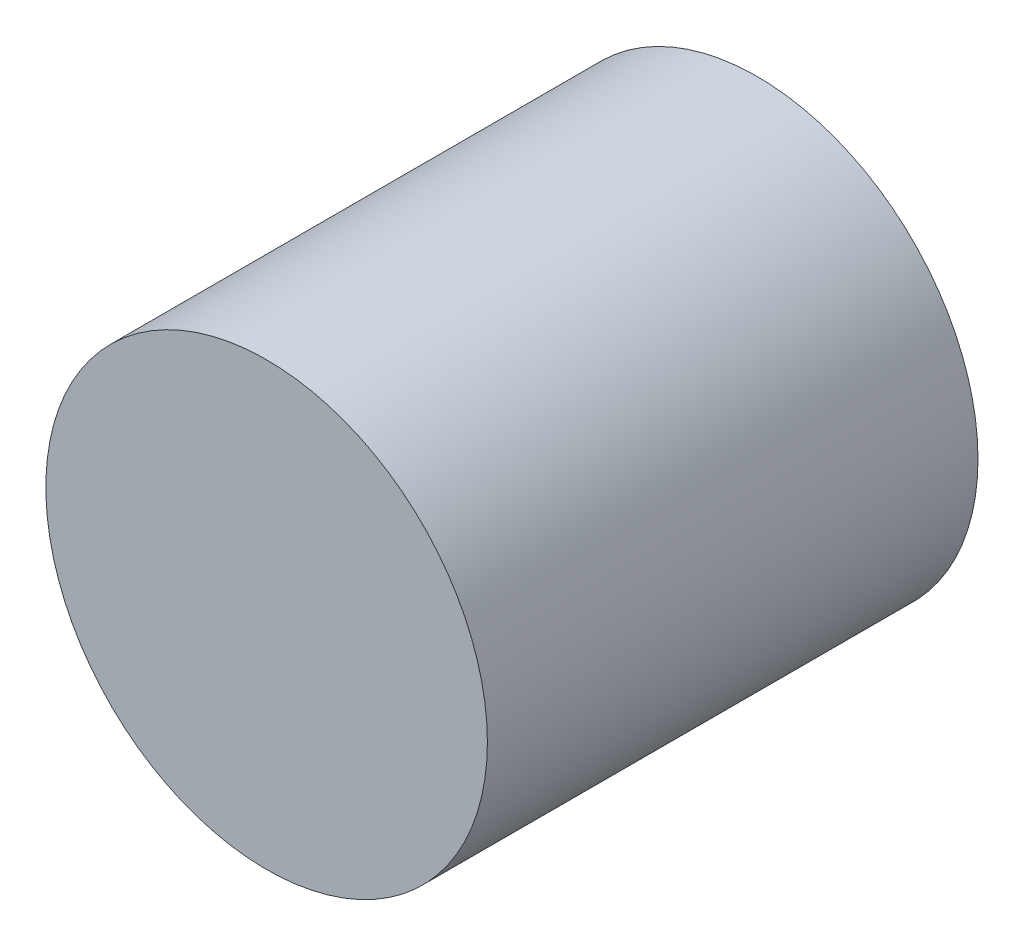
ISO-10303-21;
HEADER;
FILE_DESCRIPTION(('STEP AP214'),'2;1');
FILE_NAME('part.step','',(''),(''),'','','');
FILE_SCHEMA(('AUTOMOTIVE_DESIGN { 1 0 10303 214 1 1 1 1 }'));
ENDSEC;
DATA;
#1=APPLICATION_CONTEXT('core data for automotive mechanical design processes');
#2=APPLICATION_PROTOCOL_DEFINITION('international standard','automotive_design',2000,#1);
#3=PRODUCT_CONTEXT('',#1,'mechanical');
#4=PRODUCT('Part','Part','',(#3));
#5=PRODUCT_RELATED_PRODUCT_CATEGORY('part','',(#4));
#6=PRODUCT_DEFINITION_FORMATION('','',#4);
#7=PRODUCT_DEFINITION_CONTEXT('part definition',#1,'design');
#8=PRODUCT_DEFINITION('design','',#6,#7);
#9=PRODUCT_DEFINITION_SHAPE('','',#8);
#10=(LENGTH_UNIT() NAMED_UNIT(*) SI_UNIT(.MILLI.,.METRE.));
#11=(NAMED_UNIT(*) PLANE_ANGLE_UNIT() SI_UNIT($,.RADIAN.));
#12=(NAMED_UNIT(*) SI_UNIT($,.STERADIAN.) SOLID_ANGLE_UNIT());
#13=UNCERTAINTY_MEASURE_WITH_UNIT(LENGTH_MEASURE(1.E-05),#10,'distance_accuracy_value','');
#14=(GEOMETRIC_REPRESENTATION_CONTEXT(3) GLOBAL_UNCERTAINTY_ASSIGNED_CONTEXT((#13)) GLOBAL_UNIT_ASSIGNED_CONTEXT((#10,
#11,#12)) REPRESENTATION_CONTEXT('',''));
#15=CARTESIAN_POINT('',(0.,0.,0.));
#16=DIRECTION('',(0.,0.,1.));
#17=DIRECTION('',(1.,0.,0.));
#18=AXIS2_PLACEMENT_3D('',#15,#16,#17);
#19=CARTESIAN_POINT('',(0.,0.,10.));
#20=DIRECTION('',(0.,0.,-1.));
#21=DIRECTION('',(-1.,0.,0.));
#22=AXIS2_PLACEMENT_3D('',#19,#20,#21);
#23=CYLINDRICAL_SURFACE('',#22,4.5);
#24=CARTESIAN_POINT('',(0.,0.,10.));
#25=DIRECTION('',(0.,0.,1.));
#26=DIRECTION('',(1.,0.,0.));
#27=AXIS2_PLACEMENT_3D('',#24,#25,#26);
#28=CIRCLE('',#27,4.5);
#29=CARTESIAN_POINT('',(4.5,0.,10.));
#30=VERTEX_POINT('',#29);
#31=EDGE_CURVE('E10',#30,#30,#28,.T.);
#32=ORIENTED_EDGE('',*,*,#31,.F.);
#33=EDGE_LOOP('',(#32));
#34=FACE_BOUND('',#33,.T.);
#35=CARTESIAN_POINT('',(0.,0.,0.));
#36=DIRECTION('',(0.,0.,1.));
#37=DIRECTION('',(1.,0.,0.));
#38=AXIS2_PLACEMENT_3D('',#35,#36,#37);
#39=CIRCLE('',#38,4.5);
#40=CARTESIAN_POINT('',(4.5,0.,0.));
#41=VERTEX_POINT('',#40);
#42=EDGE_CURVE('E31',#41,#41,#39,.T.);
#43=ORIENTED_EDGE('',*,*,#42,.T.);
#44=EDGE_LOOP('',(#43));
#45=FACE_BOUND('',#44,.T.);
#46=ADVANCED_FACE('F28',(#34,#45),#23,.T.);
#47=CARTESIAN_POINT('',(0.,0.,10.));
#48=DIRECTION('',(0.,0.,1.));
#49=DIRECTION('',(1.,0.,0.));
#50=AXIS2_PLACEMENT_3D('',#47,#48,#49);
#51=PLANE('',#50);
#52=ORIENTED_EDGE('',*,*,#31,.T.);
#53=EDGE_LOOP('',(#52));
#54=FACE_BOUND('',#53,.T.);
#55=ADVANCED_FACE('F43',(#54),#51,.T.);
#56=CARTESIAN_POINT('',(0.,0.,0.));
#57=DIRECTION('',(0.,0.,1.));
#58=DIRECTION('',(1.,0.,0.));
#59=AXIS2_PLACEMENT_3D('',#56,#57,#58);
#60=PLANE('',#59);
#61=ORIENTED_EDGE('',*,*,#42,.F.);
#62=EDGE_LOOP('',(#61));
#63=FACE_BOUND('',#62,.T.);
#64=ADVANCED_FACE('F41',(#63),#60,.F.);
#65=CLOSED_SHELL('',(#46,#55,#64));
#66=MANIFOLD_SOLID_BREP('B2',#65);
#67=ADVANCED_BREP_SHAPE_REPRESENTATION('',(#18,#66),#14);
#68=SHAPE_DEFINITION_REPRESENTATION(#9,#67);
ENDSEC;
END-ISO-10303-21;
